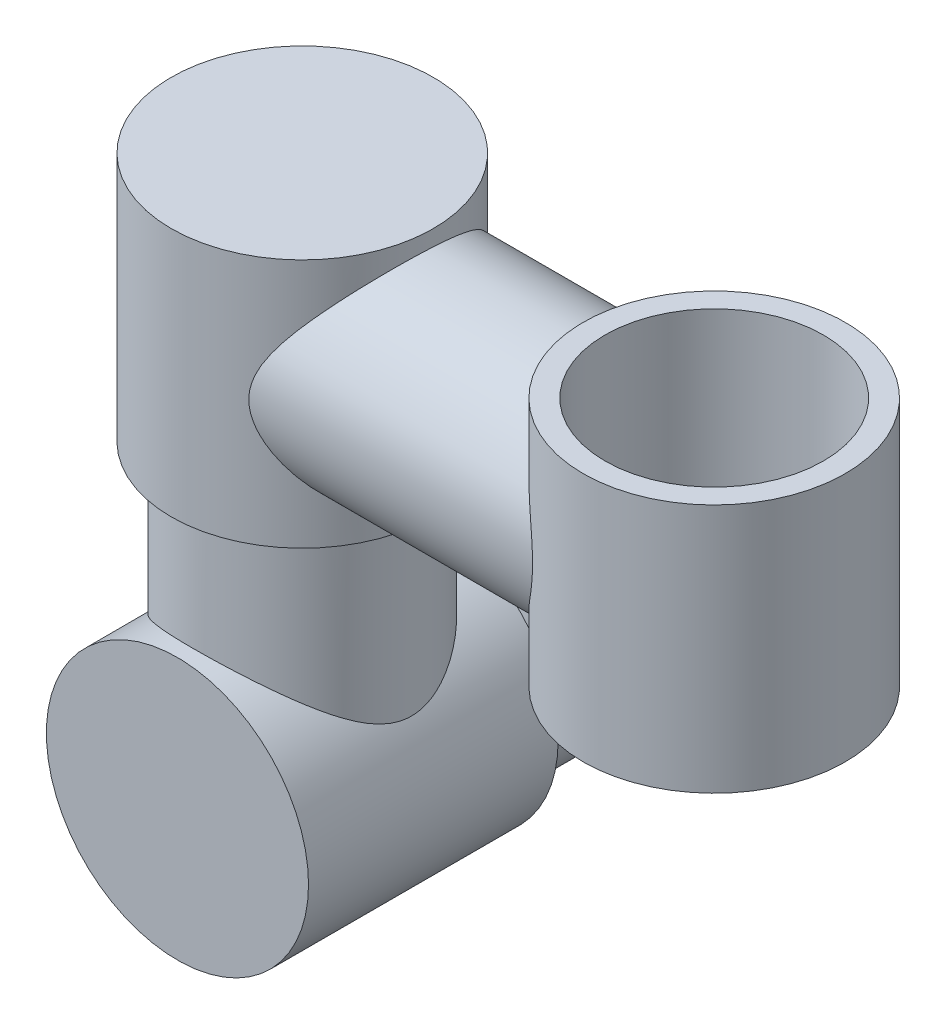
from build123d import *

# Parameters (mm, degrees)
SKETCH3_R           = 210
BOSS_EXTRUDE3_DEPTH = 400
SKETCH5_R           = 175
BOSS_EXTRUDE4_DEPTH = 250
SKETCH7_R           = 175
BOSS_EXTRUDE5_DEPTH = 410
SKETCH10_R          = 210
BOSS_EXTRUDE6_DEPTH = 400
SKETCH11_R          = 175
BOSS_EXTRUDE7_DEPTH = 620
SKETCH12_R          = 210
BOSS_EXTRUDE8_DEPTH = 200
SKETCH13_R          = 175
CUT_EXTRUDE1_DEPTH  = 250


with BuildPart() as part:
    # Sketch3 → Boss-Extrude3 (new body)
    with BuildSketch(Plane.XY):
        Circle(SKETCH3_R)
    extrude(amount=BOSS_EXTRUDE3_DEPTH)

    # Sketch5 → Boss-Extrude4 (add)
    with BuildSketch(Plane.XY):
        Circle(SKETCH5_R)
    extrude(amount=-BOSS_EXTRUDE4_DEPTH)

    # Sketch7 → Boss-Extrude5 (add)
    with BuildSketch(Plane(origin=(0, 0, 0), x_dir=(1, 0, 0), z_dir=(0, 1, 0))):
        with Locations(Location((0, -200, 0), (0, 0, 90))):
            Circle(SKETCH7_R)
    extrude(amount=BOSS_EXTRUDE5_DEPTH)

    # Sketch10 → Boss-Extrude6 (add)
    with BuildSketch(Plane(origin=(0, 410, 0), x_dir=(1, 0, 0), z_dir=(0, 1, 0))):
        with Locations(Location((0, -200, 0), (0, 0, 270))):
            Circle(SKETCH10_R)
    extrude(amount=BOSS_EXTRUDE6_DEPTH)

    # Sketch11 → Boss-Extrude7 (add)
    with BuildSketch(Plane(origin=(0, 0, 0), x_dir=(0, 0, -1), z_dir=(1, 0, 0))):
        with Locations(Location((-210, 610, 0), (0, 0, 180))):
            Circle(SKETCH11_R)
    extrude(amount=BOSS_EXTRUDE7_DEPTH)

    # Sketch12 → Boss-Extrude8 (add, symmetric)
    with BuildSketch(Plane(origin=(0, 610, 0), x_dir=(1, 0, 0), z_dir=(0, 1, 0))):
        with Locations(Location((670, -210, 0), (0, 0, 270))):
            Circle(SKETCH12_R)
    extrude(amount=BOSS_EXTRUDE8_DEPTH, both=True)

    # Sketch13 → Cut-Extrude1 (cut)
    with BuildSketch(Plane(origin=(0, 810, 0), x_dir=(1, 0, 0), z_dir=(0, 1, 0))):
        with Locations(Location((670, -210, 0), (0, 0, 270))):
            Circle(SKETCH13_R)
    extrude(amount=-CUT_EXTRUDE1_DEPTH, mode=Mode.SUBTRACT)


solid = part.part
